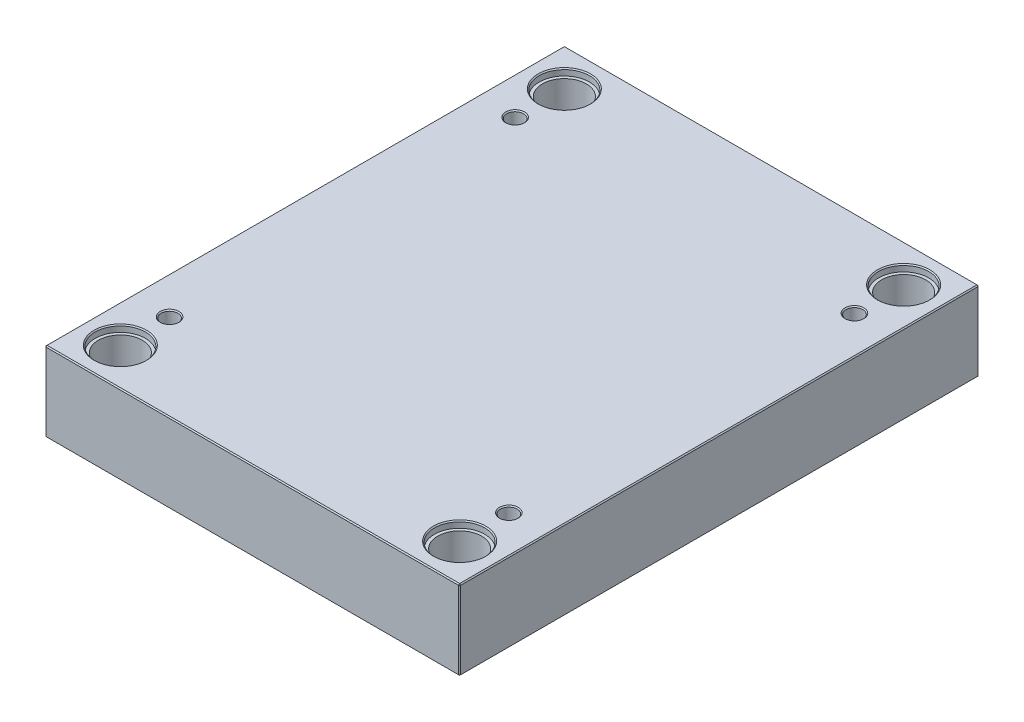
ISO-10303-21;
HEADER;
FILE_DESCRIPTION(('STEP AP214'),'2;1');
FILE_NAME('part.step','',(''),(''),'','','');
FILE_SCHEMA(('AUTOMOTIVE_DESIGN { 1 0 10303 214 1 1 1 1 }'));
ENDSEC;
DATA;
#1=APPLICATION_CONTEXT('core data for automotive mechanical design processes');
#2=APPLICATION_PROTOCOL_DEFINITION('international standard','automotive_design',2000,#1);
#3=PRODUCT_CONTEXT('',#1,'mechanical');
#4=PRODUCT('Part','Part','',(#3));
#5=PRODUCT_RELATED_PRODUCT_CATEGORY('part','',(#4));
#6=PRODUCT_DEFINITION_FORMATION('','',#4);
#7=PRODUCT_DEFINITION_CONTEXT('part definition',#1,'design');
#8=PRODUCT_DEFINITION('design','',#6,#7);
#9=PRODUCT_DEFINITION_SHAPE('','',#8);
#10=(LENGTH_UNIT() NAMED_UNIT(*) SI_UNIT(.MILLI.,.METRE.));
#11=(NAMED_UNIT(*) PLANE_ANGLE_UNIT() SI_UNIT($,.RADIAN.));
#12=(NAMED_UNIT(*) SI_UNIT($,.STERADIAN.) SOLID_ANGLE_UNIT());
#13=UNCERTAINTY_MEASURE_WITH_UNIT(LENGTH_MEASURE(1.E-05),#10,'distance_accuracy_value','');
#14=(GEOMETRIC_REPRESENTATION_CONTEXT(3) GLOBAL_UNCERTAINTY_ASSIGNED_CONTEXT((#13)) GLOBAL_UNIT_ASSIGNED_CONTEXT((#10,
#11,#12)) REPRESENTATION_CONTEXT('',''));
#15=CARTESIAN_POINT('',(0.,0.,0.));
#16=DIRECTION('',(0.,0.,1.));
#17=DIRECTION('',(1.,0.,0.));
#18=AXIS2_PLACEMENT_3D('',#15,#16,#17);
#19=CARTESIAN_POINT('',(-162.,0.,-212.));
#20=DIRECTION('',(0.,1.,0.));
#21=DIRECTION('',(0.,0.,1.));
#22=AXIS2_PLACEMENT_3D('',#19,#20,#21);
#23=CYLINDRICAL_SURFACE('',#22,21.);
#24=CARTESIAN_POINT('',(-162.,0.999999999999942,-212.));
#25=DIRECTION('',(0.,1.,0.));
#26=DIRECTION('',(0.,0.,1.));
#27=AXIS2_PLACEMENT_3D('',#24,#25,#26);
#28=CIRCLE('',#27,21.);
#29=CARTESIAN_POINT('',(-162.,0.999999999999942,-191.));
#30=VERTEX_POINT('',#29);
#31=EDGE_CURVE('E472',#30,#30,#28,.F.);
#32=ORIENTED_EDGE('',*,*,#31,.T.);
#33=EDGE_LOOP('',(#32));
#34=FACE_BOUND('',#33,.T.);
#35=CARTESIAN_POINT('',(-162.,69.7,-212.));
#36=DIRECTION('',(0.,1.,0.));
#37=DIRECTION('',(0.,0.,1.));
#38=AXIS2_PLACEMENT_3D('',#35,#36,#37);
#39=CIRCLE('',#38,21.);
#40=CARTESIAN_POINT('',(-162.,69.7,-191.));
#41=VERTEX_POINT('',#40);
#42=EDGE_CURVE('E221',#41,#41,#39,.F.);
#43=ORIENTED_EDGE('',*,*,#42,.F.);
#44=EDGE_LOOP('',(#43));
#45=FACE_BOUND('',#44,.T.);
#46=ADVANCED_FACE('F16',(#34,#45),#23,.F.);
#47=CARTESIAN_POINT('',(162.,0.,-212.));
#48=DIRECTION('',(0.,1.,0.));
#49=DIRECTION('',(0.,0.,1.));
#50=AXIS2_PLACEMENT_3D('',#47,#48,#49);
#51=CYLINDRICAL_SURFACE('',#50,21.);
#52=CARTESIAN_POINT('',(162.,0.999999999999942,-212.));
#53=DIRECTION('',(0.,1.,0.));
#54=DIRECTION('',(0.,0.,1.));
#55=AXIS2_PLACEMENT_3D('',#52,#53,#54);
#56=CIRCLE('',#55,21.);
#57=CARTESIAN_POINT('',(162.,0.999999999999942,-191.));
#58=VERTEX_POINT('',#57);
#59=EDGE_CURVE('E474',#58,#58,#56,.F.);
#60=ORIENTED_EDGE('',*,*,#59,.T.);
#61=EDGE_LOOP('',(#60));
#62=FACE_BOUND('',#61,.T.);
#63=CARTESIAN_POINT('',(162.,69.7,-212.));
#64=DIRECTION('',(0.,1.,0.));
#65=DIRECTION('',(0.,0.,1.));
#66=AXIS2_PLACEMENT_3D('',#63,#64,#65);
#67=CIRCLE('',#66,21.);
#68=CARTESIAN_POINT('',(162.,69.7,-191.));
#69=VERTEX_POINT('',#68);
#70=EDGE_CURVE('E218',#69,#69,#67,.F.);
#71=ORIENTED_EDGE('',*,*,#70,.F.);
#72=EDGE_LOOP('',(#71));
#73=FACE_BOUND('',#72,.T.);
#74=ADVANCED_FACE('F263',(#62,#73),#51,.F.);
#75=CARTESIAN_POINT('',(162.,0.,212.));
#76=DIRECTION('',(0.,1.,0.));
#77=DIRECTION('',(0.,0.,1.));
#78=AXIS2_PLACEMENT_3D('',#75,#76,#77);
#79=CYLINDRICAL_SURFACE('',#78,21.);
#80=CARTESIAN_POINT('',(162.,0.999999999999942,212.));
#81=DIRECTION('',(0.,1.,0.));
#82=DIRECTION('',(0.,0.,1.));
#83=AXIS2_PLACEMENT_3D('',#80,#81,#82);
#84=CIRCLE('',#83,21.);
#85=CARTESIAN_POINT('',(162.,0.999999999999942,233.));
#86=VERTEX_POINT('',#85);
#87=EDGE_CURVE('E477',#86,#86,#84,.F.);
#88=ORIENTED_EDGE('',*,*,#87,.T.);
#89=EDGE_LOOP('',(#88));
#90=FACE_BOUND('',#89,.T.);
#91=CARTESIAN_POINT('',(162.,69.7,212.));
#92=DIRECTION('',(0.,1.,0.));
#93=DIRECTION('',(0.,0.,1.));
#94=AXIS2_PLACEMENT_3D('',#91,#92,#93);
#95=CIRCLE('',#94,21.);
#96=CARTESIAN_POINT('',(162.,69.7,233.));
#97=VERTEX_POINT('',#96);
#98=EDGE_CURVE('E214',#97,#97,#95,.F.);
#99=ORIENTED_EDGE('',*,*,#98,.F.);
#100=EDGE_LOOP('',(#99));
#101=FACE_BOUND('',#100,.T.);
#102=ADVANCED_FACE('F270',(#90,#101),#79,.F.);
#103=CARTESIAN_POINT('',(-162.,0.,212.));
#104=DIRECTION('',(0.,1.,0.));
#105=DIRECTION('',(0.,0.,1.));
#106=AXIS2_PLACEMENT_3D('',#103,#104,#105);
#107=CYLINDRICAL_SURFACE('',#106,21.);
#108=CARTESIAN_POINT('',(-162.,0.999999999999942,212.));
#109=DIRECTION('',(0.,1.,0.));
#110=DIRECTION('',(0.,0.,1.));
#111=AXIS2_PLACEMENT_3D('',#108,#109,#110);
#112=CIRCLE('',#111,21.);
#113=CARTESIAN_POINT('',(-162.,0.999999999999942,233.));
#114=VERTEX_POINT('',#113);
#115=EDGE_CURVE('E480',#114,#114,#112,.F.);
#116=ORIENTED_EDGE('',*,*,#115,.T.);
#117=EDGE_LOOP('',(#116));
#118=FACE_BOUND('',#117,.T.);
#119=CARTESIAN_POINT('',(-162.,69.7,212.));
#120=DIRECTION('',(0.,1.,0.));
#121=DIRECTION('',(0.,0.,1.));
#122=AXIS2_PLACEMENT_3D('',#119,#120,#121);
#123=CIRCLE('',#122,21.);
#124=CARTESIAN_POINT('',(-162.,69.7,233.));
#125=VERTEX_POINT('',#124);
#126=EDGE_CURVE('E211',#125,#125,#123,.F.);
#127=ORIENTED_EDGE('',*,*,#126,.F.);
#128=EDGE_LOOP('',(#127));
#129=FACE_BOUND('',#128,.T.);
#130=ADVANCED_FACE('F277',(#118,#129),#107,.F.);
#131=CARTESIAN_POINT('',(-198.,76.,248.));
#132=DIRECTION('',(1.,0.,0.));
#133=DIRECTION('',(0.,0.,-1.));
#134=AXIS2_PLACEMENT_3D('',#131,#132,#133);
#135=PLANE('',#134);
#136=DIRECTION('',(0.,-1.,0.));
#137=VECTOR('',#136,1.);
#138=CARTESIAN_POINT('',(-198.,76.,-247.));
#139=LINE('',#138,#137);
#140=CARTESIAN_POINT('',(-198.,75.,-247.));
#141=VERTEX_POINT('',#140);
#142=CARTESIAN_POINT('',(-198.,1.00000000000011,-247.));
#143=VERTEX_POINT('',#142);
#144=EDGE_CURVE('E487',#141,#143,#139,.T.);
#145=ORIENTED_EDGE('',*,*,#144,.T.);
#146=DIRECTION('',(0.,0.,1.));
#147=VECTOR('',#146,1.);
#148=CARTESIAN_POINT('',(-198.,1.00000000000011,248.));
#149=LINE('',#148,#147);
#150=CARTESIAN_POINT('',(-198.,1.00000000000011,247.));
#151=VERTEX_POINT('',#150);
#152=EDGE_CURVE('E490',#143,#151,#149,.T.);
#153=ORIENTED_EDGE('',*,*,#152,.T.);
#154=DIRECTION('',(0.,1.,0.));
#155=VECTOR('',#154,1.);
#156=CARTESIAN_POINT('',(-198.,76.,247.));
#157=LINE('',#156,#155);
#158=CARTESIAN_POINT('',(-198.,75.,247.));
#159=VERTEX_POINT('',#158);
#160=EDGE_CURVE('E485',#151,#159,#157,.T.);
#161=ORIENTED_EDGE('',*,*,#160,.T.);
#162=DIRECTION('',(0.,0.,-1.));
#163=VECTOR('',#162,1.);
#164=CARTESIAN_POINT('',(-198.,75.,-248.));
#165=LINE('',#164,#163);
#166=EDGE_CURVE('E483',#159,#141,#165,.T.);
#167=ORIENTED_EDGE('',*,*,#166,.T.);
#168=EDGE_LOOP('',(#145,#153,#161,#167));
#169=FACE_BOUND('',#168,.T.);
#170=ADVANCED_FACE('F298',(#169),#135,.F.);
#171=CARTESIAN_POINT('',(198.,76.,248.));
#172=DIRECTION('',(0.,0.,-1.));
#173=DIRECTION('',(-1.,0.,0.));
#174=AXIS2_PLACEMENT_3D('',#171,#172,#173);
#175=PLANE('',#174);
#176=DIRECTION('',(-1.,0.,0.));
#177=VECTOR('',#176,1.);
#178=CARTESIAN_POINT('',(-198.,75.,248.));
#179=LINE('',#178,#177);
#180=CARTESIAN_POINT('',(197.,75.,248.));
#181=VERTEX_POINT('',#180);
#182=CARTESIAN_POINT('',(-197.,75.,248.));
#183=VERTEX_POINT('',#182);
#184=EDGE_CURVE('E509',#181,#183,#179,.T.);
#185=ORIENTED_EDGE('',*,*,#184,.T.);
#186=DIRECTION('',(0.,-1.,0.));
#187=VECTOR('',#186,1.);
#188=CARTESIAN_POINT('',(-197.,76.,248.));
#189=LINE('',#188,#187);
#190=CARTESIAN_POINT('',(-197.,1.00000000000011,248.));
#191=VERTEX_POINT('',#190);
#192=EDGE_CURVE('E515',#183,#191,#189,.T.);
#193=ORIENTED_EDGE('',*,*,#192,.T.);
#194=DIRECTION('',(1.,0.,0.));
#195=VECTOR('',#194,1.);
#196=CARTESIAN_POINT('',(198.,1.00000000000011,248.));
#197=LINE('',#196,#195);
#198=CARTESIAN_POINT('',(197.,1.00000000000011,248.));
#199=VERTEX_POINT('',#198);
#200=EDGE_CURVE('E513',#191,#199,#197,.T.);
#201=ORIENTED_EDGE('',*,*,#200,.T.);
#202=DIRECTION('',(0.,1.,0.));
#203=VECTOR('',#202,1.);
#204=CARTESIAN_POINT('',(197.,76.,248.));
#205=LINE('',#204,#203);
#206=EDGE_CURVE('E511',#199,#181,#205,.T.);
#207=ORIENTED_EDGE('',*,*,#206,.T.);
#208=EDGE_LOOP('',(#185,#193,#201,#207));
#209=FACE_BOUND('',#208,.T.);
#210=ADVANCED_FACE('F294',(#209),#175,.F.);
#211=CARTESIAN_POINT('',(198.,76.,248.));
#212=DIRECTION('',(-1.,0.,0.));
#213=DIRECTION('',(0.,0.,1.));
#214=AXIS2_PLACEMENT_3D('',#211,#212,#213);
#215=PLANE('',#214);
#216=DIRECTION('',(0.,0.,-1.));
#217=VECTOR('',#216,1.);
#218=CARTESIAN_POINT('',(198.,1.00000000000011,248.));
#219=LINE('',#218,#217);
#220=CARTESIAN_POINT('',(198.,1.00000000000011,247.));
#221=VERTEX_POINT('',#220);
#222=CARTESIAN_POINT('',(198.,1.00000000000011,-247.));
#223=VERTEX_POINT('',#222);
#224=EDGE_CURVE('E504',#221,#223,#219,.T.);
#225=ORIENTED_EDGE('',*,*,#224,.T.);
#226=DIRECTION('',(0.,1.,0.));
#227=VECTOR('',#226,1.);
#228=CARTESIAN_POINT('',(198.,76.,-247.));
#229=LINE('',#228,#227);
#230=CARTESIAN_POINT('',(198.,75.,-247.));
#231=VERTEX_POINT('',#230);
#232=EDGE_CURVE('E506',#223,#231,#229,.T.);
#233=ORIENTED_EDGE('',*,*,#232,.T.);
#234=DIRECTION('',(0.,0.,1.));
#235=VECTOR('',#234,1.);
#236=CARTESIAN_POINT('',(198.,75.,248.));
#237=LINE('',#236,#235);
#238=CARTESIAN_POINT('',(198.,75.,247.));
#239=VERTEX_POINT('',#238);
#240=EDGE_CURVE('E500',#231,#239,#237,.T.);
#241=ORIENTED_EDGE('',*,*,#240,.T.);
#242=DIRECTION('',(0.,-1.,0.));
#243=VECTOR('',#242,1.);
#244=CARTESIAN_POINT('',(198.,76.,247.));
#245=LINE('',#244,#243);
#246=EDGE_CURVE('E502',#239,#221,#245,.T.);
#247=ORIENTED_EDGE('',*,*,#246,.T.);
#248=EDGE_LOOP('',(#225,#233,#241,#247));
#249=FACE_BOUND('',#248,.T.);
#250=ADVANCED_FACE('F290',(#249),#215,.F.);
#251=CARTESIAN_POINT('',(198.,76.,-248.));
#252=DIRECTION('',(0.,0.,1.));
#253=DIRECTION('',(1.,0.,0.));
#254=AXIS2_PLACEMENT_3D('',#251,#252,#253);
#255=PLANE('',#254);
#256=DIRECTION('',(0.,-1.,0.));
#257=VECTOR('',#256,1.);
#258=CARTESIAN_POINT('',(197.,76.,-248.));
#259=LINE('',#258,#257);
#260=CARTESIAN_POINT('',(197.,75.,-248.));
#261=VERTEX_POINT('',#260);
#262=CARTESIAN_POINT('',(197.,1.00000000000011,-248.));
#263=VERTEX_POINT('',#262);
#264=EDGE_CURVE('E494',#261,#263,#259,.T.);
#265=ORIENTED_EDGE('',*,*,#264,.T.);
#266=DIRECTION('',(-1.,0.,0.));
#267=VECTOR('',#266,1.);
#268=CARTESIAN_POINT('',(198.,1.00000000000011,-248.));
#269=LINE('',#268,#267);
#270=CARTESIAN_POINT('',(-197.,1.00000000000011,-248.));
#271=VERTEX_POINT('',#270);
#272=EDGE_CURVE('E138',#263,#271,#269,.T.);
#273=ORIENTED_EDGE('',*,*,#272,.T.);
#274=DIRECTION('',(0.,1.,0.));
#275=VECTOR('',#274,1.);
#276=CARTESIAN_POINT('',(-197.,76.,-248.));
#277=LINE('',#276,#275);
#278=CARTESIAN_POINT('',(-197.,75.,-248.));
#279=VERTEX_POINT('',#278);
#280=EDGE_CURVE('E496',#271,#279,#277,.T.);
#281=ORIENTED_EDGE('',*,*,#280,.T.);
#282=DIRECTION('',(1.,0.,0.));
#283=VECTOR('',#282,1.);
#284=CARTESIAN_POINT('',(198.,75.,-248.));
#285=LINE('',#284,#283);
#286=EDGE_CURVE('E492',#279,#261,#285,.T.);
#287=ORIENTED_EDGE('',*,*,#286,.T.);
#288=EDGE_LOOP('',(#265,#273,#281,#287));
#289=FACE_BOUND('',#288,.T.);
#290=ADVANCED_FACE('F282',(#289),#255,.F.);
#291=CARTESIAN_POINT('',(0.,76.,0.));
#292=DIRECTION('',(0.,1.,0.));
#293=DIRECTION('',(0.,0.,1.));
#294=AXIS2_PLACEMENT_3D('',#291,#292,#293);
#295=PLANE('',#294);
#296=CARTESIAN_POINT('',(162.,76.,212.));
#297=DIRECTION('',(0.,1.,0.));
#298=DIRECTION('',(0.,0.,1.));
#299=AXIS2_PLACEMENT_3D('',#296,#297,#298);
#300=CIRCLE('',#299,25.);
#301=CARTESIAN_POINT('',(162.,76.,237.));
#302=VERTEX_POINT('',#301);
#303=EDGE_CURVE('E236',#302,#302,#300,.F.);
#304=ORIENTED_EDGE('',*,*,#303,.T.);
#305=EDGE_LOOP('',(#304));
#306=FACE_BOUND('',#305,.T.);
#307=CARTESIAN_POINT('',(-162.,76.,212.));
#308=DIRECTION('',(0.,1.,0.));
#309=DIRECTION('',(0.,0.,1.));
#310=AXIS2_PLACEMENT_3D('',#307,#308,#309);
#311=CIRCLE('',#310,25.);
#312=CARTESIAN_POINT('',(-162.,76.,237.));
#313=VERTEX_POINT('',#312);
#314=EDGE_CURVE('E233',#313,#313,#311,.F.);
#315=ORIENTED_EDGE('',*,*,#314,.T.);
#316=EDGE_LOOP('',(#315));
#317=FACE_BOUND('',#316,.T.);
#318=CARTESIAN_POINT('',(162.,76.,-212.));
#319=DIRECTION('',(0.,1.,0.));
#320=DIRECTION('',(0.,0.,1.));
#321=AXIS2_PLACEMENT_3D('',#318,#319,#320);
#322=CIRCLE('',#321,25.);
#323=CARTESIAN_POINT('',(162.,76.,-187.));
#324=VERTEX_POINT('',#323);
#325=EDGE_CURVE('E230',#324,#324,#322,.F.);
#326=ORIENTED_EDGE('',*,*,#325,.T.);
#327=EDGE_LOOP('',(#326));
#328=FACE_BOUND('',#327,.T.);
#329=CARTESIAN_POINT('',(-162.,76.,-212.));
#330=DIRECTION('',(0.,1.,0.));
#331=DIRECTION('',(0.,0.,1.));
#332=AXIS2_PLACEMENT_3D('',#329,#330,#331);
#333=CIRCLE('',#332,25.);
#334=CARTESIAN_POINT('',(-162.,76.,-187.));
#335=VERTEX_POINT('',#334);
#336=EDGE_CURVE('E227',#335,#335,#333,.F.);
#337=ORIENTED_EDGE('',*,*,#336,.T.);
#338=EDGE_LOOP('',(#337));
#339=FACE_BOUND('',#338,.T.);
#340=CARTESIAN_POINT('',(-162.,76.,165.));
#341=DIRECTION('',(0.,1.,0.));
#342=DIRECTION('',(0.,0.,1.));
#343=AXIS2_PLACEMENT_3D('',#340,#341,#342);
#344=CIRCLE('',#343,9.00000000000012);
#345=CARTESIAN_POINT('',(-162.,76.,174.));
#346=VERTEX_POINT('',#345);
#347=EDGE_CURVE('E198',#346,#346,#344,.F.);
#348=ORIENTED_EDGE('',*,*,#347,.T.);
#349=EDGE_LOOP('',(#348));
#350=FACE_BOUND('',#349,.T.);
#351=CARTESIAN_POINT('',(162.,76.,165.));
#352=DIRECTION('',(0.,1.,0.));
#353=DIRECTION('',(0.,0.,1.));
#354=AXIS2_PLACEMENT_3D('',#351,#352,#353);
#355=CIRCLE('',#354,9.00000000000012);
#356=CARTESIAN_POINT('',(162.,76.,174.));
#357=VERTEX_POINT('',#356);
#358=EDGE_CURVE('E195',#357,#357,#355,.F.);
#359=ORIENTED_EDGE('',*,*,#358,.T.);
#360=EDGE_LOOP('',(#359));
#361=FACE_BOUND('',#360,.T.);
#362=CARTESIAN_POINT('',(162.,76.,-165.));
#363=DIRECTION('',(0.,1.,0.));
#364=DIRECTION('',(0.,0.,1.));
#365=AXIS2_PLACEMENT_3D('',#362,#363,#364);
#366=CIRCLE('',#365,9.);
#367=CARTESIAN_POINT('',(162.,76.,-156.));
#368=VERTEX_POINT('',#367);
#369=EDGE_CURVE('E192',#368,#368,#366,.F.);
#370=ORIENTED_EDGE('',*,*,#369,.T.);
#371=EDGE_LOOP('',(#370));
#372=FACE_BOUND('',#371,.T.);
#373=CARTESIAN_POINT('',(-162.,76.,-165.));
#374=DIRECTION('',(0.,1.,0.));
#375=DIRECTION('',(0.,0.,1.));
#376=AXIS2_PLACEMENT_3D('',#373,#374,#375);
#377=CIRCLE('',#376,9.00000000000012);
#378=CARTESIAN_POINT('',(-162.,76.,-156.));
#379=VERTEX_POINT('',#378);
#380=EDGE_CURVE('E188',#379,#379,#377,.F.);
#381=ORIENTED_EDGE('',*,*,#380,.T.);
#382=EDGE_LOOP('',(#381));
#383=FACE_BOUND('',#382,.T.);
#384=DIRECTION('',(0.,0.,-1.));
#385=VECTOR('',#384,1.);
#386=CARTESIAN_POINT('',(197.,76.,-248.));
#387=LINE('',#386,#385);
#388=CARTESIAN_POINT('',(197.,76.,247.));
#389=VERTEX_POINT('',#388);
#390=CARTESIAN_POINT('',(197.,76.,-247.));
#391=VERTEX_POINT('',#390);
#392=EDGE_CURVE('E31',#389,#391,#387,.T.);
#393=ORIENTED_EDGE('',*,*,#392,.T.);
#394=DIRECTION('',(-1.,0.,0.));
#395=VECTOR('',#394,1.);
#396=CARTESIAN_POINT('',(-198.,76.,-247.));
#397=LINE('',#396,#395);
#398=CARTESIAN_POINT('',(-197.,76.,-247.));
#399=VERTEX_POINT('',#398);
#400=EDGE_CURVE('E189',#391,#399,#397,.T.);
#401=ORIENTED_EDGE('',*,*,#400,.T.);
#402=DIRECTION('',(0.,0.,1.));
#403=VECTOR('',#402,1.);
#404=CARTESIAN_POINT('',(-197.,76.,248.));
#405=LINE('',#404,#403);
#406=CARTESIAN_POINT('',(-197.,76.,247.));
#407=VERTEX_POINT('',#406);
#408=EDGE_CURVE('E518',#399,#407,#405,.T.);
#409=ORIENTED_EDGE('',*,*,#408,.T.);
#410=DIRECTION('',(1.,0.,0.));
#411=VECTOR('',#410,1.);
#412=CARTESIAN_POINT('',(198.,76.,247.));
#413=LINE('',#412,#411);
#414=EDGE_CURVE('E36',#407,#389,#413,.T.);
#415=ORIENTED_EDGE('',*,*,#414,.T.);
#416=EDGE_LOOP('',(#393,#401,#409,#415));
#417=FACE_BOUND('',#416,.T.);
#418=ADVANCED_FACE('F279',(#306,#317,#328,#339,#350,#361,#372,#383,#417),#295,.T.);
#419=CARTESIAN_POINT('',(0.,0.,0.));
#420=DIRECTION('',(0.,1.,0.));
#421=DIRECTION('',(0.,0.,1.));
#422=AXIS2_PLACEMENT_3D('',#419,#420,#421);
#423=PLANE('',#422);
#424=CARTESIAN_POINT('',(-162.,0.,-212.));
#425=DIRECTION('',(0.,1.,0.));
#426=DIRECTION('',(0.,0.,1.));
#427=AXIS2_PLACEMENT_3D('',#424,#425,#426);
#428=CIRCLE('',#427,22.);
#429=CARTESIAN_POINT('',(-162.,0.,-190.));
#430=VERTEX_POINT('',#429);
#431=EDGE_CURVE('E469',#430,#430,#428,.T.);
#432=ORIENTED_EDGE('',*,*,#431,.T.);
#433=EDGE_LOOP('',(#432));
#434=FACE_BOUND('',#433,.T.);
#435=CARTESIAN_POINT('',(162.,0.,-212.));
#436=DIRECTION('',(0.,1.,0.));
#437=DIRECTION('',(0.,0.,1.));
#438=AXIS2_PLACEMENT_3D('',#435,#436,#437);
#439=CIRCLE('',#438,22.);
#440=CARTESIAN_POINT('',(162.,0.,-190.));
#441=VERTEX_POINT('',#440);
#442=EDGE_CURVE('E466',#441,#441,#439,.T.);
#443=ORIENTED_EDGE('',*,*,#442,.T.);
#444=EDGE_LOOP('',(#443));
#445=FACE_BOUND('',#444,.T.);
#446=CARTESIAN_POINT('',(162.,0.,212.));
#447=DIRECTION('',(0.,1.,0.));
#448=DIRECTION('',(0.,0.,1.));
#449=AXIS2_PLACEMENT_3D('',#446,#447,#448);
#450=CIRCLE('',#449,22.);
#451=CARTESIAN_POINT('',(162.,0.,234.));
#452=VERTEX_POINT('',#451);
#453=EDGE_CURVE('E463',#452,#452,#450,.T.);
#454=ORIENTED_EDGE('',*,*,#453,.T.);
#455=EDGE_LOOP('',(#454));
#456=FACE_BOUND('',#455,.T.);
#457=CARTESIAN_POINT('',(-162.,0.,212.));
#458=DIRECTION('',(0.,1.,0.));
#459=DIRECTION('',(0.,0.,1.));
#460=AXIS2_PLACEMENT_3D('',#457,#458,#459);
#461=CIRCLE('',#460,22.);
#462=CARTESIAN_POINT('',(-162.,0.,234.));
#463=VERTEX_POINT('',#462);
#464=EDGE_CURVE('E460',#463,#463,#461,.T.);
#465=ORIENTED_EDGE('',*,*,#464,.T.);
#466=EDGE_LOOP('',(#465));
#467=FACE_BOUND('',#466,.T.);
#468=DIRECTION('',(0.,0.,1.));
#469=VECTOR('',#468,1.);
#470=CARTESIAN_POINT('',(197.,0.,0.));
#471=LINE('',#470,#469);
#472=CARTESIAN_POINT('',(197.,0.,-247.));
#473=VERTEX_POINT('',#472);
#474=CARTESIAN_POINT('',(197.,0.,247.));
#475=VERTEX_POINT('',#474);
#476=EDGE_CURVE('E108',#473,#475,#471,.T.);
#477=ORIENTED_EDGE('',*,*,#476,.T.);
#478=DIRECTION('',(-1.,0.,0.));
#479=VECTOR('',#478,1.);
#480=CARTESIAN_POINT('',(0.,0.,247.));
#481=LINE('',#480,#479);
#482=CARTESIAN_POINT('',(-197.,0.,247.));
#483=VERTEX_POINT('',#482);
#484=EDGE_CURVE('E458',#475,#483,#481,.T.);
#485=ORIENTED_EDGE('',*,*,#484,.T.);
#486=DIRECTION('',(0.,0.,-1.));
#487=VECTOR('',#486,1.);
#488=CARTESIAN_POINT('',(-197.,0.,0.));
#489=LINE('',#488,#487);
#490=CARTESIAN_POINT('',(-197.,0.,-247.));
#491=VERTEX_POINT('',#490);
#492=EDGE_CURVE('E110',#483,#491,#489,.T.);
#493=ORIENTED_EDGE('',*,*,#492,.T.);
#494=DIRECTION('',(1.,0.,0.));
#495=VECTOR('',#494,1.);
#496=CARTESIAN_POINT('',(0.,0.,-247.));
#497=LINE('',#496,#495);
#498=EDGE_CURVE('E104',#491,#473,#497,.T.);
#499=ORIENTED_EDGE('',*,*,#498,.T.);
#500=EDGE_LOOP('',(#477,#485,#493,#499));
#501=FACE_BOUND('',#500,.T.);
#502=ADVANCED_FACE('F106',(#434,#445,#456,#467,#501),#423,.F.);
#503=CARTESIAN_POINT('',(-162.,0.,-212.));
#504=DIRECTION('',(0.,-1.,0.));
#505=DIRECTION('',(0.,0.,-1.));
#506=AXIS2_PLACEMENT_3D('',#503,#504,#505);
#507=CONICAL_SURFACE('',#506,22.,0.785398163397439);
#508=ORIENTED_EDGE('',*,*,#31,.F.);
#509=EDGE_LOOP('',(#508));
#510=FACE_BOUND('',#509,.T.);
#511=ORIENTED_EDGE('',*,*,#431,.F.);
#512=EDGE_LOOP('',(#511));
#513=FACE_BOUND('',#512,.T.);
#514=ADVANCED_FACE('F286',(#510,#513),#507,.F.);
#515=CARTESIAN_POINT('',(162.,0.,-212.));
#516=DIRECTION('',(0.,-1.,0.));
#517=DIRECTION('',(0.,0.,-1.));
#518=AXIS2_PLACEMENT_3D('',#515,#516,#517);
#519=CONICAL_SURFACE('',#518,22.,0.785398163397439);
#520=ORIENTED_EDGE('',*,*,#59,.F.);
#521=EDGE_LOOP('',(#520));
#522=FACE_BOUND('',#521,.T.);
#523=ORIENTED_EDGE('',*,*,#442,.F.);
#524=EDGE_LOOP('',(#523));
#525=FACE_BOUND('',#524,.T.);
#526=ADVANCED_FACE('F305',(#522,#525),#519,.F.);
#527=CARTESIAN_POINT('',(162.,0.,212.));
#528=DIRECTION('',(0.,-1.,0.));
#529=DIRECTION('',(0.,0.,-1.));
#530=AXIS2_PLACEMENT_3D('',#527,#528,#529);
#531=CONICAL_SURFACE('',#530,22.,0.785398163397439);
#532=ORIENTED_EDGE('',*,*,#87,.F.);
#533=EDGE_LOOP('',(#532));
#534=FACE_BOUND('',#533,.T.);
#535=ORIENTED_EDGE('',*,*,#453,.F.);
#536=EDGE_LOOP('',(#535));
#537=FACE_BOUND('',#536,.T.);
#538=ADVANCED_FACE('F309',(#534,#537),#531,.F.);
#539=CARTESIAN_POINT('',(-162.,0.,212.));
#540=DIRECTION('',(0.,-1.,0.));
#541=DIRECTION('',(0.,0.,-1.));
#542=AXIS2_PLACEMENT_3D('',#539,#540,#541);
#543=CONICAL_SURFACE('',#542,22.,0.785398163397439);
#544=ORIENTED_EDGE('',*,*,#115,.F.);
#545=EDGE_LOOP('',(#544));
#546=FACE_BOUND('',#545,.T.);
#547=ORIENTED_EDGE('',*,*,#464,.F.);
#548=EDGE_LOOP('',(#547));
#549=FACE_BOUND('',#548,.T.);
#550=ADVANCED_FACE('F313',(#546,#549),#543,.F.);
#551=CARTESIAN_POINT('',(198.,76.,247.));
#552=DIRECTION('',(-0.707106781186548,0.,-0.707106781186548));
#553=DIRECTION('',(0.,-1.,0.));
#554=AXIS2_PLACEMENT_3D('',#551,#552,#553);
#555=PLANE('',#554);
#556=DIRECTION('',(-0.707106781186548,0.,0.707106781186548));
#557=VECTOR('',#556,1.);
#558=CARTESIAN_POINT('',(197.,75.,248.));
#559=LINE('',#558,#557);
#560=EDGE_CURVE('E126',#181,#239,#559,.F.);
#561=ORIENTED_EDGE('',*,*,#560,.F.);
#562=ORIENTED_EDGE('',*,*,#206,.F.);
#563=DIRECTION('',(0.707106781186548,0.,-0.707106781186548));
#564=VECTOR('',#563,1.);
#565=CARTESIAN_POINT('',(197.,1.00000000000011,248.));
#566=LINE('',#565,#564);
#567=EDGE_CURVE('E180',#221,#199,#566,.F.);
#568=ORIENTED_EDGE('',*,*,#567,.F.);
#569=ORIENTED_EDGE('',*,*,#246,.F.);
#570=EDGE_LOOP('',(#561,#562,#568,#569));
#571=FACE_BOUND('',#570,.T.);
#572=ADVANCED_FACE('F317',(#571),#555,.F.);
#573=CARTESIAN_POINT('',(197.,75.,248.));
#574=DIRECTION('',(0.577350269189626,0.577350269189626,0.577350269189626));
#575=DIRECTION('',(0.707106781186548,0.,-0.707106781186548));
#576=AXIS2_PLACEMENT_3D('',#573,#574,#575);
#577=PLANE('',#576);
#578=DIRECTION('',(0.,-0.707106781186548,0.707106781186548));
#579=VECTOR('',#578,1.);
#580=CARTESIAN_POINT('',(197.,75.,248.));
#581=LINE('',#580,#579);
#582=EDGE_CURVE('E175',#181,#389,#581,.F.);
#583=ORIENTED_EDGE('',*,*,#582,.F.);
#584=ORIENTED_EDGE('',*,*,#560,.T.);
#585=DIRECTION('',(-0.707106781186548,0.707106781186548,0.));
#586=VECTOR('',#585,1.);
#587=CARTESIAN_POINT('',(197.5,75.5,247.));
#588=LINE('',#587,#586);
#589=EDGE_CURVE('E177',#389,#239,#588,.F.);
#590=ORIENTED_EDGE('',*,*,#589,.F.);
#591=EDGE_LOOP('',(#583,#584,#590));
#592=FACE_BOUND('',#591,.T.);
#593=ADVANCED_FACE('F385',(#592),#577,.T.);
#594=CARTESIAN_POINT('',(197.,1.00000000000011,248.));
#595=DIRECTION('',(0.577350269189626,-0.577350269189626,0.577350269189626));
#596=DIRECTION('',(0.707106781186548,0.,-0.707106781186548));
#597=AXIS2_PLACEMENT_3D('',#594,#595,#596);
#598=PLANE('',#597);
#599=DIRECTION('',(-0.707106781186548,-0.707106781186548,0.));
#600=VECTOR('',#599,1.);
#601=CARTESIAN_POINT('',(197.5,0.500000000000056,247.));
#602=LINE('',#601,#600);
#603=EDGE_CURVE('E124',#221,#475,#602,.T.);
#604=ORIENTED_EDGE('',*,*,#603,.F.);
#605=ORIENTED_EDGE('',*,*,#567,.T.);
#606=DIRECTION('',(0.,0.707106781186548,0.707106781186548));
#607=VECTOR('',#606,1.);
#608=CARTESIAN_POINT('',(197.,1.00000000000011,248.));
#609=LINE('',#608,#607);
#610=EDGE_CURVE('E172',#475,#199,#609,.T.);
#611=ORIENTED_EDGE('',*,*,#610,.F.);
#612=EDGE_LOOP('',(#604,#605,#611));
#613=FACE_BOUND('',#612,.T.);
#614=ADVANCED_FACE('F381',(#613),#598,.T.);
#615=CARTESIAN_POINT('',(197.,76.,0.));
#616=DIRECTION('',(0.707106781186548,0.707106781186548,0.));
#617=DIRECTION('',(0.,0.,1.));
#618=AXIS2_PLACEMENT_3D('',#615,#616,#617);
#619=PLANE('',#618);
#620=ORIENTED_EDGE('',*,*,#589,.T.);
#621=ORIENTED_EDGE('',*,*,#240,.F.);
#622=DIRECTION('',(0.707106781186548,-0.707106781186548,0.));
#623=VECTOR('',#622,1.);
#624=CARTESIAN_POINT('',(198.,75.,-247.));
#625=LINE('',#624,#623);
#626=EDGE_CURVE('E166',#391,#231,#625,.T.);
#627=ORIENTED_EDGE('',*,*,#626,.F.);
#628=ORIENTED_EDGE('',*,*,#392,.F.);
#629=EDGE_LOOP('',(#620,#621,#627,#628));
#630=FACE_BOUND('',#629,.T.);
#631=ADVANCED_FACE('F377',(#630),#619,.T.);
#632=CARTESIAN_POINT('',(0.,76.,247.));
#633=DIRECTION('',(0.,0.707106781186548,0.707106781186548));
#634=DIRECTION('',(-1.,0.,0.));
#635=AXIS2_PLACEMENT_3D('',#632,#633,#634);
#636=PLANE('',#635);
#637=ORIENTED_EDGE('',*,*,#582,.T.);
#638=ORIENTED_EDGE('',*,*,#414,.F.);
#639=DIRECTION('',(0.,0.707106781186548,-0.707106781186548));
#640=VECTOR('',#639,1.);
#641=CARTESIAN_POINT('',(-197.,75.5,247.5));
#642=LINE('',#641,#640);
#643=EDGE_CURVE('E163',#183,#407,#642,.T.);
#644=ORIENTED_EDGE('',*,*,#643,.F.);
#645=ORIENTED_EDGE('',*,*,#184,.F.);
#646=EDGE_LOOP('',(#637,#638,#644,#645));
#647=FACE_BOUND('',#646,.T.);
#648=ADVANCED_FACE('F373',(#647),#636,.T.);
#649=CARTESIAN_POINT('',(-197.,76.,248.));
#650=DIRECTION('',(0.707106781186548,0.,-0.707106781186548));
#651=DIRECTION('',(0.,-1.,0.));
#652=AXIS2_PLACEMENT_3D('',#649,#650,#651);
#653=PLANE('',#652);
#654=DIRECTION('',(0.707106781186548,0.,0.707106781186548));
#655=VECTOR('',#654,1.);
#656=CARTESIAN_POINT('',(-197.,1.00000000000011,248.));
#657=LINE('',#656,#655);
#658=EDGE_CURVE('E157',#191,#151,#657,.F.);
#659=ORIENTED_EDGE('',*,*,#658,.F.);
#660=ORIENTED_EDGE('',*,*,#192,.F.);
#661=DIRECTION('',(-0.707106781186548,0.,-0.707106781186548));
#662=VECTOR('',#661,1.);
#663=CARTESIAN_POINT('',(-198.,75.,247.));
#664=LINE('',#663,#662);
#665=EDGE_CURVE('E160',#159,#183,#664,.F.);
#666=ORIENTED_EDGE('',*,*,#665,.F.);
#667=ORIENTED_EDGE('',*,*,#160,.F.);
#668=EDGE_LOOP('',(#659,#660,#666,#667));
#669=FACE_BOUND('',#668,.T.);
#670=ADVANCED_FACE('F369',(#669),#653,.F.);
#671=CARTESIAN_POINT('',(198.,1.00000000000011,248.));
#672=DIRECTION('',(0.,0.707106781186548,-0.707106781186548));
#673=DIRECTION('',(1.,0.,0.));
#674=AXIS2_PLACEMENT_3D('',#671,#672,#673);
#675=PLANE('',#674);
#676=ORIENTED_EDGE('',*,*,#610,.T.);
#677=ORIENTED_EDGE('',*,*,#200,.F.);
#678=DIRECTION('',(0.,-0.707106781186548,-0.707106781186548));
#679=VECTOR('',#678,1.);
#680=CARTESIAN_POINT('',(-197.,1.00000000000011,248.));
#681=LINE('',#680,#679);
#682=EDGE_CURVE('E135',#483,#191,#681,.F.);
#683=ORIENTED_EDGE('',*,*,#682,.F.);
#684=ORIENTED_EDGE('',*,*,#484,.F.);
#685=EDGE_LOOP('',(#676,#677,#683,#684));
#686=FACE_BOUND('',#685,.T.);
#687=ADVANCED_FACE('F366',(#686),#675,.F.);
#688=CARTESIAN_POINT('',(198.,1.00000000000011,248.));
#689=DIRECTION('',(-0.707106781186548,0.707106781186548,0.));
#690=DIRECTION('',(0.,0.,-1.));
#691=AXIS2_PLACEMENT_3D('',#688,#689,#690);
#692=PLANE('',#691);
#693=ORIENTED_EDGE('',*,*,#603,.T.);
#694=ORIENTED_EDGE('',*,*,#476,.F.);
#695=DIRECTION('',(0.707106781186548,0.707106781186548,0.));
#696=VECTOR('',#695,1.);
#697=CARTESIAN_POINT('',(197.5,0.50000000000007,-247.));
#698=LINE('',#697,#696);
#699=EDGE_CURVE('E121',#223,#473,#698,.F.);
#700=ORIENTED_EDGE('',*,*,#699,.F.);
#701=ORIENTED_EDGE('',*,*,#224,.F.);
#702=EDGE_LOOP('',(#693,#694,#700,#701));
#703=FACE_BOUND('',#702,.T.);
#704=ADVANCED_FACE('F119',(#703),#692,.F.);
#705=CARTESIAN_POINT('',(197.,76.,-248.));
#706=DIRECTION('',(-0.707106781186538,0.,0.707106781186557));
#707=DIRECTION('',(0.,-1.,0.));
#708=AXIS2_PLACEMENT_3D('',#705,#706,#707);
#709=PLANE('',#708);
#710=DIRECTION('',(0.707106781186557,0.,0.707106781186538));
#711=VECTOR('',#710,1.);
#712=CARTESIAN_POINT('',(198.,75.,-247.));
#713=LINE('',#712,#711);
#714=EDGE_CURVE('E168',#231,#261,#713,.F.);
#715=ORIENTED_EDGE('',*,*,#714,.F.);
#716=ORIENTED_EDGE('',*,*,#232,.F.);
#717=DIRECTION('',(-0.707106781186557,0.,-0.707106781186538));
#718=VECTOR('',#717,1.);
#719=CARTESIAN_POINT('',(197.,1.00000000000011,-248.));
#720=LINE('',#719,#718);
#721=EDGE_CURVE('E134',#263,#223,#720,.F.);
#722=ORIENTED_EDGE('',*,*,#721,.F.);
#723=ORIENTED_EDGE('',*,*,#264,.F.);
#724=EDGE_LOOP('',(#715,#716,#722,#723));
#725=FACE_BOUND('',#724,.T.);
#726=ADVANCED_FACE('F359',(#725),#709,.F.);
#727=CARTESIAN_POINT('',(198.,75.,-247.));
#728=DIRECTION('',(0.577350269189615,0.577350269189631,-0.577350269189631));
#729=DIRECTION('',(0.,0.707106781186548,0.707106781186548));
#730=AXIS2_PLACEMENT_3D('',#727,#728,#729);
#731=PLANE('',#730);
#732=ORIENTED_EDGE('',*,*,#626,.T.);
#733=ORIENTED_EDGE('',*,*,#714,.T.);
#734=DIRECTION('',(0.,0.707106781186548,0.707106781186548));
#735=VECTOR('',#734,1.);
#736=CARTESIAN_POINT('',(197.,75.5,-247.5));
#737=LINE('',#736,#735);
#738=EDGE_CURVE('E152',#391,#261,#737,.F.);
#739=ORIENTED_EDGE('',*,*,#738,.F.);
#740=EDGE_LOOP('',(#732,#733,#739));
#741=FACE_BOUND('',#740,.T.);
#742=ADVANCED_FACE('F355',(#741),#731,.T.);
#743=CARTESIAN_POINT('',(-198.,75.,247.));
#744=DIRECTION('',(-0.577350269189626,0.577350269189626,0.577350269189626));
#745=DIRECTION('',(0.707106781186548,0.,0.707106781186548));
#746=AXIS2_PLACEMENT_3D('',#743,#744,#745);
#747=PLANE('',#746);
#748=ORIENTED_EDGE('',*,*,#665,.T.);
#749=ORIENTED_EDGE('',*,*,#643,.T.);
#750=DIRECTION('',(-0.707106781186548,-0.707106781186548,0.));
#751=VECTOR('',#750,1.);
#752=CARTESIAN_POINT('',(-198.,75.,247.));
#753=LINE('',#752,#751);
#754=EDGE_CURVE('E143',#159,#407,#753,.F.);
#755=ORIENTED_EDGE('',*,*,#754,.F.);
#756=EDGE_LOOP('',(#748,#749,#755));
#757=FACE_BOUND('',#756,.T.);
#758=ADVANCED_FACE('F351',(#757),#747,.T.);
#759=CARTESIAN_POINT('',(-197.,1.00000000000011,248.));
#760=DIRECTION('',(-0.577350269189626,-0.577350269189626,0.577350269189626));
#761=DIRECTION('',(0.707106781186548,0.,0.707106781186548));
#762=AXIS2_PLACEMENT_3D('',#759,#760,#761);
#763=PLANE('',#762);
#764=ORIENTED_EDGE('',*,*,#682,.T.);
#765=ORIENTED_EDGE('',*,*,#658,.T.);
#766=DIRECTION('',(-0.707106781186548,0.707106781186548,0.));
#767=VECTOR('',#766,1.);
#768=CARTESIAN_POINT('',(-197.5,0.500000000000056,247.));
#769=LINE('',#768,#767);
#770=EDGE_CURVE('E139',#483,#151,#769,.T.);
#771=ORIENTED_EDGE('',*,*,#770,.F.);
#772=EDGE_LOOP('',(#764,#765,#771));
#773=FACE_BOUND('',#772,.T.);
#774=ADVANCED_FACE('F348',(#773),#763,.T.);
#775=CARTESIAN_POINT('',(197.,1.00000000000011,-248.));
#776=DIRECTION('',(0.577350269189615,-0.577350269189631,-0.577350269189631));
#777=DIRECTION('',(0.,0.707106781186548,-0.707106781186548));
#778=AXIS2_PLACEMENT_3D('',#775,#776,#777);
#779=PLANE('',#778);
#780=ORIENTED_EDGE('',*,*,#721,.T.);
#781=ORIENTED_EDGE('',*,*,#699,.T.);
#782=DIRECTION('',(0.,-0.707106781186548,0.707106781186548));
#783=VECTOR('',#782,1.);
#784=CARTESIAN_POINT('',(197.,1.00000000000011,-248.));
#785=LINE('',#784,#783);
#786=EDGE_CURVE('E131',#263,#473,#785,.T.);
#787=ORIENTED_EDGE('',*,*,#786,.F.);
#788=EDGE_LOOP('',(#780,#781,#787));
#789=FACE_BOUND('',#788,.T.);
#790=ADVANCED_FACE('F130',(#789),#779,.T.);
#791=CARTESIAN_POINT('',(0.,76.,-247.));
#792=DIRECTION('',(0.,0.707106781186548,-0.707106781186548));
#793=DIRECTION('',(1.,0.,0.));
#794=AXIS2_PLACEMENT_3D('',#791,#792,#793);
#795=PLANE('',#794);
#796=ORIENTED_EDGE('',*,*,#738,.T.);
#797=ORIENTED_EDGE('',*,*,#286,.F.);
#798=DIRECTION('',(0.,-0.707106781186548,-0.707106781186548));
#799=VECTOR('',#798,1.);
#800=CARTESIAN_POINT('',(-197.,75.,-248.));
#801=LINE('',#800,#799);
#802=EDGE_CURVE('E140',#399,#279,#801,.T.);
#803=ORIENTED_EDGE('',*,*,#802,.F.);
#804=ORIENTED_EDGE('',*,*,#400,.F.);
#805=EDGE_LOOP('',(#796,#797,#803,#804));
#806=FACE_BOUND('',#805,.T.);
#807=ADVANCED_FACE('F341',(#806),#795,.T.);
#808=CARTESIAN_POINT('',(-197.,76.,0.));
#809=DIRECTION('',(-0.707106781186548,0.707106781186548,0.));
#810=DIRECTION('',(0.,0.,-1.));
#811=AXIS2_PLACEMENT_3D('',#808,#809,#810);
#812=PLANE('',#811);
#813=ORIENTED_EDGE('',*,*,#754,.T.);
#814=ORIENTED_EDGE('',*,*,#408,.F.);
#815=DIRECTION('',(0.707106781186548,0.707106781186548,0.));
#816=VECTOR('',#815,1.);
#817=CARTESIAN_POINT('',(-197.5,75.5,-247.));
#818=LINE('',#817,#816);
#819=EDGE_CURVE('E146',#141,#399,#818,.T.);
#820=ORIENTED_EDGE('',*,*,#819,.F.);
#821=ORIENTED_EDGE('',*,*,#166,.F.);
#822=EDGE_LOOP('',(#813,#814,#820,#821));
#823=FACE_BOUND('',#822,.T.);
#824=ADVANCED_FACE('F337',(#823),#812,.T.);
#825=CARTESIAN_POINT('',(-198.,1.00000000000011,248.));
#826=DIRECTION('',(0.707106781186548,0.707106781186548,0.));
#827=DIRECTION('',(0.,0.,1.));
#828=AXIS2_PLACEMENT_3D('',#825,#826,#827);
#829=PLANE('',#828);
#830=ORIENTED_EDGE('',*,*,#770,.T.);
#831=ORIENTED_EDGE('',*,*,#152,.F.);
#832=DIRECTION('',(0.707106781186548,-0.707106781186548,0.));
#833=VECTOR('',#832,1.);
#834=CARTESIAN_POINT('',(-198.,1.00000000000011,-247.));
#835=LINE('',#834,#833);
#836=EDGE_CURVE('E529',#491,#143,#835,.F.);
#837=ORIENTED_EDGE('',*,*,#836,.F.);
#838=ORIENTED_EDGE('',*,*,#492,.F.);
#839=EDGE_LOOP('',(#830,#831,#837,#838));
#840=FACE_BOUND('',#839,.T.);
#841=ADVANCED_FACE('F334',(#840),#829,.F.);
#842=CARTESIAN_POINT('',(198.,1.00000000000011,-248.));
#843=DIRECTION('',(0.,0.707106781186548,0.707106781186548));
#844=DIRECTION('',(-1.,0.,0.));
#845=AXIS2_PLACEMENT_3D('',#842,#843,#844);
#846=PLANE('',#845);
#847=ORIENTED_EDGE('',*,*,#786,.T.);
#848=ORIENTED_EDGE('',*,*,#498,.F.);
#849=DIRECTION('',(0.,0.707106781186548,-0.707106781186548));
#850=VECTOR('',#849,1.);
#851=CARTESIAN_POINT('',(-197.,0.500000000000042,-247.5));
#852=LINE('',#851,#850);
#853=EDGE_CURVE('E526',#271,#491,#852,.F.);
#854=ORIENTED_EDGE('',*,*,#853,.F.);
#855=ORIENTED_EDGE('',*,*,#272,.F.);
#856=EDGE_LOOP('',(#847,#848,#854,#855));
#857=FACE_BOUND('',#856,.T.);
#858=ADVANCED_FACE('F137',(#857),#846,.F.);
#859=CARTESIAN_POINT('',(-197.,75.,-248.));
#860=DIRECTION('',(-0.577350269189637,0.577350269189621,-0.577350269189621));
#861=DIRECTION('',(-0.707106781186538,0.,0.707106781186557));
#862=AXIS2_PLACEMENT_3D('',#859,#860,#861);
#863=PLANE('',#862);
#864=ORIENTED_EDGE('',*,*,#819,.T.);
#865=ORIENTED_EDGE('',*,*,#802,.T.);
#866=DIRECTION('',(0.707106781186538,0.,-0.707106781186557));
#867=VECTOR('',#866,1.);
#868=CARTESIAN_POINT('',(-197.,75.,-248.));
#869=LINE('',#868,#867);
#870=EDGE_CURVE('E524',#141,#279,#869,.T.);
#871=ORIENTED_EDGE('',*,*,#870,.F.);
#872=EDGE_LOOP('',(#864,#865,#871));
#873=FACE_BOUND('',#872,.T.);
#874=ADVANCED_FACE('F327',(#873),#863,.T.);
#875=CARTESIAN_POINT('',(-198.,1.00000000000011,-247.));
#876=DIRECTION('',(-0.577350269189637,-0.577350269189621,-0.577350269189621));
#877=DIRECTION('',(-0.707106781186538,0.,0.707106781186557));
#878=AXIS2_PLACEMENT_3D('',#875,#876,#877);
#879=PLANE('',#878);
#880=ORIENTED_EDGE('',*,*,#853,.T.);
#881=ORIENTED_EDGE('',*,*,#836,.T.);
#882=DIRECTION('',(-0.707106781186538,0.,0.707106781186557));
#883=VECTOR('',#882,1.);
#884=CARTESIAN_POINT('',(-198.,1.00000000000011,-247.));
#885=LINE('',#884,#883);
#886=EDGE_CURVE('E455',#271,#143,#885,.T.);
#887=ORIENTED_EDGE('',*,*,#886,.F.);
#888=EDGE_LOOP('',(#880,#881,#887));
#889=FACE_BOUND('',#888,.T.);
#890=ADVANCED_FACE('F323',(#889),#879,.T.);
#891=CARTESIAN_POINT('',(-198.,76.,-247.));
#892=DIRECTION('',(0.707106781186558,0.,0.707106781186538));
#893=DIRECTION('',(0.,-1.,0.));
#894=AXIS2_PLACEMENT_3D('',#891,#892,#893);
#895=PLANE('',#894);
#896=ORIENTED_EDGE('',*,*,#870,.T.);
#897=ORIENTED_EDGE('',*,*,#280,.F.);
#898=ORIENTED_EDGE('',*,*,#886,.T.);
#899=ORIENTED_EDGE('',*,*,#144,.F.);
#900=EDGE_LOOP('',(#896,#897,#898,#899));
#901=FACE_BOUND('',#900,.T.);
#902=ADVANCED_FACE('F319',(#901),#895,.F.);
#903=CARTESIAN_POINT('',(-162.,51.,-165.));
#904=DIRECTION('',(0.,1.,0.));
#905=DIRECTION('',(0.,0.,1.));
#906=AXIS2_PLACEMENT_3D('',#903,#904,#905);
#907=CYLINDRICAL_SURFACE('',#906,8.);
#908=CARTESIAN_POINT('',(-162.,75.,-165.));
#909=DIRECTION('',(0.,1.,0.));
#910=DIRECTION('',(0.,0.,1.));
#911=AXIS2_PLACEMENT_3D('',#908,#909,#910);
#912=CIRCLE('',#911,8.);
#913=CARTESIAN_POINT('',(-162.,75.,-157.));
#914=VERTEX_POINT('',#913);
#915=EDGE_CURVE('E207',#914,#914,#912,.T.);
#916=ORIENTED_EDGE('',*,*,#915,.T.);
#917=EDGE_LOOP('',(#916));
#918=FACE_BOUND('',#917,.T.);
#919=CARTESIAN_POINT('',(-162.,51.,-165.));
#920=DIRECTION('',(0.,1.,0.));
#921=DIRECTION('',(0.,0.,1.));
#922=AXIS2_PLACEMENT_3D('',#919,#920,#921);
#923=CIRCLE('',#922,8.);
#924=CARTESIAN_POINT('',(-162.,51.,-157.));
#925=VERTEX_POINT('',#924);
#926=EDGE_CURVE('E448',#925,#925,#923,.T.);
#927=ORIENTED_EDGE('',*,*,#926,.F.);
#928=EDGE_LOOP('',(#927));
#929=FACE_BOUND('',#928,.T.);
#930=ADVANCED_FACE('F322',(#918,#929),#907,.F.);
#931=CARTESIAN_POINT('',(-162.,51.,-165.));
#932=DIRECTION('',(0.,1.,0.));
#933=DIRECTION('',(0.,0.,1.));
#934=AXIS2_PLACEMENT_3D('',#931,#932,#933);
#935=PLANE('',#934);
#936=ORIENTED_EDGE('',*,*,#926,.T.);
#937=EDGE_LOOP('',(#936));
#938=FACE_BOUND('',#937,.T.);
#939=ADVANCED_FACE('F596',(#938),#935,.T.);
#940=CARTESIAN_POINT('',(162.,51.,-165.));
#941=DIRECTION('',(0.,1.,0.));
#942=DIRECTION('',(0.,0.,1.));
#943=AXIS2_PLACEMENT_3D('',#940,#941,#942);
#944=CYLINDRICAL_SURFACE('',#943,8.);
#945=CARTESIAN_POINT('',(162.,75.,-165.));
#946=DIRECTION('',(0.,1.,0.));
#947=DIRECTION('',(0.,0.,1.));
#948=AXIS2_PLACEMENT_3D('',#945,#946,#947);
#949=CIRCLE('',#948,8.);
#950=CARTESIAN_POINT('',(162.,75.,-157.));
#951=VERTEX_POINT('',#950);
#952=EDGE_CURVE('E204',#951,#951,#949,.T.);
#953=ORIENTED_EDGE('',*,*,#952,.T.);
#954=EDGE_LOOP('',(#953));
#955=FACE_BOUND('',#954,.T.);
#956=CARTESIAN_POINT('',(162.,51.,-165.));
#957=DIRECTION('',(0.,1.,0.));
#958=DIRECTION('',(0.,0.,1.));
#959=AXIS2_PLACEMENT_3D('',#956,#957,#958);
#960=CIRCLE('',#959,8.);
#961=CARTESIAN_POINT('',(162.,51.,-157.));
#962=VERTEX_POINT('',#961);
#963=EDGE_CURVE('E445',#962,#962,#960,.T.);
#964=ORIENTED_EDGE('',*,*,#963,.F.);
#965=EDGE_LOOP('',(#964));
#966=FACE_BOUND('',#965,.T.);
#967=ADVANCED_FACE('F592',(#955,#966),#944,.F.);
#968=CARTESIAN_POINT('',(162.,51.,-165.));
#969=DIRECTION('',(0.,1.,0.));
#970=DIRECTION('',(0.,0.,1.));
#971=AXIS2_PLACEMENT_3D('',#968,#969,#970);
#972=PLANE('',#971);
#973=ORIENTED_EDGE('',*,*,#963,.T.);
#974=EDGE_LOOP('',(#973));
#975=FACE_BOUND('',#974,.T.);
#976=ADVANCED_FACE('F588',(#975),#972,.T.);
#977=CARTESIAN_POINT('',(162.,51.,165.));
#978=DIRECTION('',(0.,1.,0.));
#979=DIRECTION('',(0.,0.,1.));
#980=AXIS2_PLACEMENT_3D('',#977,#978,#979);
#981=CYLINDRICAL_SURFACE('',#980,8.);
#982=CARTESIAN_POINT('',(162.,75.,165.));
#983=DIRECTION('',(0.,1.,0.));
#984=DIRECTION('',(0.,0.,1.));
#985=AXIS2_PLACEMENT_3D('',#982,#983,#984);
#986=CIRCLE('',#985,8.);
#987=CARTESIAN_POINT('',(162.,75.,173.));
#988=VERTEX_POINT('',#987);
#989=EDGE_CURVE('E201',#988,#988,#986,.T.);
#990=ORIENTED_EDGE('',*,*,#989,.T.);
#991=EDGE_LOOP('',(#990));
#992=FACE_BOUND('',#991,.T.);
#993=CARTESIAN_POINT('',(162.,51.,165.));
#994=DIRECTION('',(0.,1.,0.));
#995=DIRECTION('',(0.,0.,1.));
#996=AXIS2_PLACEMENT_3D('',#993,#994,#995);
#997=CIRCLE('',#996,8.);
#998=CARTESIAN_POINT('',(162.,51.,173.));
#999=VERTEX_POINT('',#998);
#1000=EDGE_CURVE('E449',#999,#999,#997,.T.);
#1001=ORIENTED_EDGE('',*,*,#1000,.F.);
#1002=EDGE_LOOP('',(#1001));
#1003=FACE_BOUND('',#1002,.T.);
#1004=ADVANCED_FACE('F591',(#992,#1003),#981,.F.);
#1005=CARTESIAN_POINT('',(162.,51.,165.));
#1006=DIRECTION('',(0.,1.,0.));
#1007=DIRECTION('',(0.,0.,1.));
#1008=AXIS2_PLACEMENT_3D('',#1005,#1006,#1007);
#1009=PLANE('',#1008);
#1010=ORIENTED_EDGE('',*,*,#1000,.T.);
#1011=EDGE_LOOP('',(#1010));
#1012=FACE_BOUND('',#1011,.T.);
#1013=ADVANCED_FACE('F598',(#1012),#1009,.T.);
#1014=CARTESIAN_POINT('',(-162.,51.,165.));
#1015=DIRECTION('',(0.,1.,0.));
#1016=DIRECTION('',(0.,0.,1.));
#1017=AXIS2_PLACEMENT_3D('',#1014,#1015,#1016);
#1018=CYLINDRICAL_SURFACE('',#1017,8.);
#1019=CARTESIAN_POINT('',(-162.,75.,165.));
#1020=DIRECTION('',(0.,1.,0.));
#1021=DIRECTION('',(0.,0.,1.));
#1022=AXIS2_PLACEMENT_3D('',#1019,#1020,#1021);
#1023=CIRCLE('',#1022,8.);
#1024=CARTESIAN_POINT('',(-162.,75.,173.));
#1025=VERTEX_POINT('',#1024);
#1026=EDGE_CURVE('E185',#1025,#1025,#1023,.T.);
#1027=ORIENTED_EDGE('',*,*,#1026,.T.);
#1028=EDGE_LOOP('',(#1027));
#1029=FACE_BOUND('',#1028,.T.);
#1030=CARTESIAN_POINT('',(-162.,51.,165.));
#1031=DIRECTION('',(0.,1.,0.));
#1032=DIRECTION('',(0.,0.,1.));
#1033=AXIS2_PLACEMENT_3D('',#1030,#1031,#1032);
#1034=CIRCLE('',#1033,8.);
#1035=CARTESIAN_POINT('',(-162.,51.,173.));
#1036=VERTEX_POINT('',#1035);
#1037=EDGE_CURVE('E224',#1036,#1036,#1034,.T.);
#1038=ORIENTED_EDGE('',*,*,#1037,.F.);
#1039=EDGE_LOOP('',(#1038));
#1040=FACE_BOUND('',#1039,.T.);
#1041=ADVANCED_FACE('F601',(#1029,#1040),#1018,.F.);
#1042=CARTESIAN_POINT('',(-162.,51.,165.));
#1043=DIRECTION('',(0.,1.,0.));
#1044=DIRECTION('',(0.,0.,1.));
#1045=AXIS2_PLACEMENT_3D('',#1042,#1043,#1044);
#1046=PLANE('',#1045);
#1047=ORIENTED_EDGE('',*,*,#1037,.T.);
#1048=EDGE_LOOP('',(#1047));
#1049=FACE_BOUND('',#1048,.T.);
#1050=ADVANCED_FACE('F397',(#1049),#1046,.T.);
#1051=CARTESIAN_POINT('',(-162.,75.,165.));
#1052=DIRECTION('',(0.,1.,0.));
#1053=DIRECTION('',(0.,0.,1.));
#1054=AXIS2_PLACEMENT_3D('',#1051,#1052,#1053);
#1055=CONICAL_SURFACE('',#1054,8.,0.785398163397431);
#1056=ORIENTED_EDGE('',*,*,#347,.F.);
#1057=EDGE_LOOP('',(#1056));
#1058=FACE_BOUND('',#1057,.T.);
#1059=ORIENTED_EDGE('',*,*,#1026,.F.);
#1060=EDGE_LOOP('',(#1059));
#1061=FACE_BOUND('',#1060,.T.);
#1062=ADVANCED_FACE('F393',(#1058,#1061),#1055,.F.);
#1063=CARTESIAN_POINT('',(162.,75.,165.));
#1064=DIRECTION('',(0.,1.,0.));
#1065=DIRECTION('',(0.,0.,1.));
#1066=AXIS2_PLACEMENT_3D('',#1063,#1064,#1065);
#1067=CONICAL_SURFACE('',#1066,8.,0.785398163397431);
#1068=ORIENTED_EDGE('',*,*,#358,.F.);
#1069=EDGE_LOOP('',(#1068));
#1070=FACE_BOUND('',#1069,.T.);
#1071=ORIENTED_EDGE('',*,*,#989,.F.);
#1072=EDGE_LOOP('',(#1071));
#1073=FACE_BOUND('',#1072,.T.);
#1074=ADVANCED_FACE('F396',(#1070,#1073),#1067,.F.);
#1075=CARTESIAN_POINT('',(162.,75.,-165.));
#1076=DIRECTION('',(0.,1.,0.));
#1077=DIRECTION('',(0.,0.,1.));
#1078=AXIS2_PLACEMENT_3D('',#1075,#1076,#1077);
#1079=CONICAL_SURFACE('',#1078,8.,0.785398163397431);
#1080=ORIENTED_EDGE('',*,*,#369,.F.);
#1081=EDGE_LOOP('',(#1080));
#1082=FACE_BOUND('',#1081,.T.);
#1083=ORIENTED_EDGE('',*,*,#952,.F.);
#1084=EDGE_LOOP('',(#1083));
#1085=FACE_BOUND('',#1084,.T.);
#1086=ADVANCED_FACE('F401',(#1082,#1085),#1079,.F.);
#1087=CARTESIAN_POINT('',(-162.,75.,-165.));
#1088=DIRECTION('',(0.,1.,0.));
#1089=DIRECTION('',(0.,0.,1.));
#1090=AXIS2_PLACEMENT_3D('',#1087,#1088,#1089);
#1091=CONICAL_SURFACE('',#1090,8.,0.785398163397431);
#1092=ORIENTED_EDGE('',*,*,#380,.F.);
#1093=EDGE_LOOP('',(#1092));
#1094=FACE_BOUND('',#1093,.T.);
#1095=ORIENTED_EDGE('',*,*,#915,.F.);
#1096=EDGE_LOOP('',(#1095));
#1097=FACE_BOUND('',#1096,.T.);
#1098=ADVANCED_FACE('F405',(#1094,#1097),#1091,.F.);
#1099=CARTESIAN_POINT('',(-162.,69.7,212.));
#1100=DIRECTION('',(0.,1.,0.));
#1101=DIRECTION('',(0.,0.,1.));
#1102=AXIS2_PLACEMENT_3D('',#1099,#1100,#1101);
#1103=PLANE('',#1102);
#1104=CARTESIAN_POINT('',(-162.,69.7,212.));
#1105=DIRECTION('',(0.,1.,0.));
#1106=DIRECTION('',(0.,0.,1.));
#1107=AXIS2_PLACEMENT_3D('',#1104,#1105,#1106);
#1108=CIRCLE('',#1107,24.);
#1109=CARTESIAN_POINT('',(-162.,69.7,236.));
#1110=VERTEX_POINT('',#1109);
#1111=EDGE_CURVE('E436',#1110,#1110,#1108,.T.);
#1112=ORIENTED_EDGE('',*,*,#1111,.T.);
#1113=EDGE_LOOP('',(#1112));
#1114=FACE_BOUND('',#1113,.T.);
#1115=ORIENTED_EDGE('',*,*,#126,.T.);
#1116=EDGE_LOOP('',(#1115));
#1117=FACE_BOUND('',#1116,.T.);
#1118=ADVANCED_FACE('F409',(#1114,#1117),#1103,.T.);
#1119=CARTESIAN_POINT('',(-162.,69.7,212.));
#1120=DIRECTION('',(0.,1.,0.));
#1121=DIRECTION('',(0.,0.,1.));
#1122=AXIS2_PLACEMENT_3D('',#1119,#1120,#1121);
#1123=CYLINDRICAL_SURFACE('',#1122,24.);
#1124=CARTESIAN_POINT('',(-162.,75.,212.));
#1125=DIRECTION('',(0.,1.,0.));
#1126=DIRECTION('',(0.,0.,1.));
#1127=AXIS2_PLACEMENT_3D('',#1124,#1125,#1126);
#1128=CIRCLE('',#1127,24.);
#1129=CARTESIAN_POINT('',(-162.,75.,236.));
#1130=VERTEX_POINT('',#1129);
#1131=EDGE_CURVE('E239',#1130,#1130,#1128,.T.);
#1132=ORIENTED_EDGE('',*,*,#1131,.T.);
#1133=EDGE_LOOP('',(#1132));
#1134=FACE_BOUND('',#1133,.T.);
#1135=ORIENTED_EDGE('',*,*,#1111,.F.);
#1136=EDGE_LOOP('',(#1135));
#1137=FACE_BOUND('',#1136,.T.);
#1138=ADVANCED_FACE('F574',(#1134,#1137),#1123,.F.);
#1139=CARTESIAN_POINT('',(162.,69.7,212.));
#1140=DIRECTION('',(0.,1.,0.));
#1141=DIRECTION('',(0.,0.,1.));
#1142=AXIS2_PLACEMENT_3D('',#1139,#1140,#1141);
#1143=PLANE('',#1142);
#1144=CARTESIAN_POINT('',(162.,69.7,212.));
#1145=DIRECTION('',(0.,1.,0.));
#1146=DIRECTION('',(0.,0.,1.));
#1147=AXIS2_PLACEMENT_3D('',#1144,#1145,#1146);
#1148=CIRCLE('',#1147,24.);
#1149=CARTESIAN_POINT('',(162.,69.7,236.));
#1150=VERTEX_POINT('',#1149);
#1151=EDGE_CURVE('E433',#1150,#1150,#1148,.T.);
#1152=ORIENTED_EDGE('',*,*,#1151,.T.);
#1153=EDGE_LOOP('',(#1152));
#1154=FACE_BOUND('',#1153,.T.);
#1155=ORIENTED_EDGE('',*,*,#98,.T.);
#1156=EDGE_LOOP('',(#1155));
#1157=FACE_BOUND('',#1156,.T.);
#1158=ADVANCED_FACE('F429',(#1154,#1157),#1143,.T.);
#1159=CARTESIAN_POINT('',(162.,69.7,212.));
#1160=DIRECTION('',(0.,1.,0.));
#1161=DIRECTION('',(0.,0.,1.));
#1162=AXIS2_PLACEMENT_3D('',#1159,#1160,#1161);
#1163=CYLINDRICAL_SURFACE('',#1162,24.);
#1164=CARTESIAN_POINT('',(162.,75.,212.));
#1165=DIRECTION('',(0.,1.,0.));
#1166=DIRECTION('',(0.,0.,1.));
#1167=AXIS2_PLACEMENT_3D('',#1164,#1165,#1166);
#1168=CIRCLE('',#1167,24.);
#1169=CARTESIAN_POINT('',(162.,75.,236.));
#1170=VERTEX_POINT('',#1169);
#1171=EDGE_CURVE('E210',#1170,#1170,#1168,.T.);
#1172=ORIENTED_EDGE('',*,*,#1171,.T.);
#1173=EDGE_LOOP('',(#1172));
#1174=FACE_BOUND('',#1173,.T.);
#1175=ORIENTED_EDGE('',*,*,#1151,.F.);
#1176=EDGE_LOOP('',(#1175));
#1177=FACE_BOUND('',#1176,.T.);
#1178=ADVANCED_FACE('F425',(#1174,#1177),#1163,.F.);
#1179=CARTESIAN_POINT('',(162.,69.7,-212.));
#1180=DIRECTION('',(0.,1.,0.));
#1181=DIRECTION('',(0.,0.,1.));
#1182=AXIS2_PLACEMENT_3D('',#1179,#1180,#1181);
#1183=PLANE('',#1182);
#1184=CARTESIAN_POINT('',(162.,69.7,-212.));
#1185=DIRECTION('',(0.,1.,0.));
#1186=DIRECTION('',(0.,0.,1.));
#1187=AXIS2_PLACEMENT_3D('',#1184,#1185,#1186);
#1188=CIRCLE('',#1187,24.);
#1189=CARTESIAN_POINT('',(162.,69.7,-188.));
#1190=VERTEX_POINT('',#1189);
#1191=EDGE_CURVE('E435',#1190,#1190,#1188,.T.);
#1192=ORIENTED_EDGE('',*,*,#1191,.T.);
#1193=EDGE_LOOP('',(#1192));
#1194=FACE_BOUND('',#1193,.T.);
#1195=ORIENTED_EDGE('',*,*,#70,.T.);
#1196=EDGE_LOOP('',(#1195));
#1197=FACE_BOUND('',#1196,.T.);
#1198=ADVANCED_FACE('F428',(#1194,#1197),#1183,.T.);
#1199=CARTESIAN_POINT('',(162.,69.7,-212.));
#1200=DIRECTION('',(0.,1.,0.));
#1201=DIRECTION('',(0.,0.,1.));
#1202=AXIS2_PLACEMENT_3D('',#1199,#1200,#1201);
#1203=CYLINDRICAL_SURFACE('',#1202,24.);
#1204=CARTESIAN_POINT('',(162.,75.,-212.));
#1205=DIRECTION('',(0.,1.,0.));
#1206=DIRECTION('',(0.,0.,1.));
#1207=AXIS2_PLACEMENT_3D('',#1204,#1205,#1206);
#1208=CIRCLE('',#1207,24.);
#1209=CARTESIAN_POINT('',(162.,75.,-188.));
#1210=VERTEX_POINT('',#1209);
#1211=EDGE_CURVE('E24',#1210,#1210,#1208,.T.);
#1212=ORIENTED_EDGE('',*,*,#1211,.T.);
#1213=EDGE_LOOP('',(#1212));
#1214=FACE_BOUND('',#1213,.T.);
#1215=ORIENTED_EDGE('',*,*,#1191,.F.);
#1216=EDGE_LOOP('',(#1215));
#1217=FACE_BOUND('',#1216,.T.);
#1218=ADVANCED_FACE('F244',(#1214,#1217),#1203,.F.);
#1219=CARTESIAN_POINT('',(-162.,69.7,-212.));
#1220=DIRECTION('',(0.,1.,0.));
#1221=DIRECTION('',(0.,0.,1.));
#1222=AXIS2_PLACEMENT_3D('',#1219,#1220,#1221);
#1223=PLANE('',#1222);
#1224=CARTESIAN_POINT('',(-162.,69.7,-212.));
#1225=DIRECTION('',(0.,1.,0.));
#1226=DIRECTION('',(0.,0.,1.));
#1227=AXIS2_PLACEMENT_3D('',#1224,#1225,#1226);
#1228=CIRCLE('',#1227,24.);
#1229=CARTESIAN_POINT('',(-162.,69.7,-188.));
#1230=VERTEX_POINT('',#1229);
#1231=EDGE_CURVE('E215',#1230,#1230,#1228,.T.);
#1232=ORIENTED_EDGE('',*,*,#1231,.T.);
#1233=EDGE_LOOP('',(#1232));
#1234=FACE_BOUND('',#1233,.T.);
#1235=ORIENTED_EDGE('',*,*,#42,.T.);
#1236=EDGE_LOOP('',(#1235));
#1237=FACE_BOUND('',#1236,.T.);
#1238=ADVANCED_FACE('F418',(#1234,#1237),#1223,.T.);
#1239=CARTESIAN_POINT('',(-162.,69.7,-212.));
#1240=DIRECTION('',(0.,1.,0.));
#1241=DIRECTION('',(0.,0.,1.));
#1242=AXIS2_PLACEMENT_3D('',#1239,#1240,#1241);
#1243=CYLINDRICAL_SURFACE('',#1242,24.);
#1244=CARTESIAN_POINT('',(-162.,75.,-212.));
#1245=DIRECTION('',(0.,1.,0.));
#1246=DIRECTION('',(0.,0.,1.));
#1247=AXIS2_PLACEMENT_3D('',#1244,#1245,#1246);
#1248=CIRCLE('',#1247,24.);
#1249=CARTESIAN_POINT('',(-162.,75.,-188.));
#1250=VERTEX_POINT('',#1249);
#1251=EDGE_CURVE('E10',#1250,#1250,#1248,.T.);
#1252=ORIENTED_EDGE('',*,*,#1251,.T.);
#1253=EDGE_LOOP('',(#1252));
#1254=FACE_BOUND('',#1253,.T.);
#1255=ORIENTED_EDGE('',*,*,#1231,.F.);
#1256=EDGE_LOOP('',(#1255));
#1257=FACE_BOUND('',#1256,.T.);
#1258=ADVANCED_FACE('F412',(#1254,#1257),#1243,.F.);
#1259=CARTESIAN_POINT('',(162.,75.,212.));
#1260=DIRECTION('',(0.,1.,0.));
#1261=DIRECTION('',(0.,0.,1.));
#1262=AXIS2_PLACEMENT_3D('',#1259,#1260,#1261);
#1263=CONICAL_SURFACE('',#1262,24.,0.785398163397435);
#1264=ORIENTED_EDGE('',*,*,#303,.F.);
#1265=EDGE_LOOP('',(#1264));
#1266=FACE_BOUND('',#1265,.T.);
#1267=ORIENTED_EDGE('',*,*,#1171,.F.);
#1268=EDGE_LOOP('',(#1267));
#1269=FACE_BOUND('',#1268,.T.);
#1270=ADVANCED_FACE('F258',(#1266,#1269),#1263,.F.);
#1271=CARTESIAN_POINT('',(-162.,75.,212.));
#1272=DIRECTION('',(0.,1.,0.));
#1273=DIRECTION('',(0.,0.,1.));
#1274=AXIS2_PLACEMENT_3D('',#1271,#1272,#1273);
#1275=CONICAL_SURFACE('',#1274,24.,0.785398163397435);
#1276=ORIENTED_EDGE('',*,*,#314,.F.);
#1277=EDGE_LOOP('',(#1276));
#1278=FACE_BOUND('',#1277,.T.);
#1279=ORIENTED_EDGE('',*,*,#1131,.F.);
#1280=EDGE_LOOP('',(#1279));
#1281=FACE_BOUND('',#1280,.T.);
#1282=ADVANCED_FACE('F249',(#1278,#1281),#1275,.F.);
#1283=CARTESIAN_POINT('',(162.,75.,-212.));
#1284=DIRECTION('',(0.,1.,0.));
#1285=DIRECTION('',(0.,0.,1.));
#1286=AXIS2_PLACEMENT_3D('',#1283,#1284,#1285);
#1287=CONICAL_SURFACE('',#1286,24.,0.785398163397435);
#1288=ORIENTED_EDGE('',*,*,#325,.F.);
#1289=EDGE_LOOP('',(#1288));
#1290=FACE_BOUND('',#1289,.T.);
#1291=ORIENTED_EDGE('',*,*,#1211,.F.);
#1292=EDGE_LOOP('',(#1291));
#1293=FACE_BOUND('',#1292,.T.);
#1294=ADVANCED_FACE('F247',(#1290,#1293),#1287,.F.);
#1295=CARTESIAN_POINT('',(-162.,75.,-212.));
#1296=DIRECTION('',(0.,1.,0.));
#1297=DIRECTION('',(0.,0.,1.));
#1298=AXIS2_PLACEMENT_3D('',#1295,#1296,#1297);
#1299=CONICAL_SURFACE('',#1298,24.,0.785398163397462);
#1300=ORIENTED_EDGE('',*,*,#336,.F.);
#1301=EDGE_LOOP('',(#1300));
#1302=FACE_BOUND('',#1301,.T.);
#1303=ORIENTED_EDGE('',*,*,#1251,.F.);
#1304=EDGE_LOOP('',(#1303));
#1305=FACE_BOUND('',#1304,.T.);
#1306=ADVANCED_FACE('F18',(#1302,#1305),#1299,.F.);
#1307=CLOSED_SHELL('',(#46,#74,#102,#130,#170,#210,#250,#290,#418,#502,#514,#526,#538,#550,#572,
#593,#614,#631,#648,#670,#687,#704,#726,#742,#758,#774,#790,#807,#824,#841,#858,#874,#890,#902,
#930,#939,#967,#976,#1004,#1013,#1041,#1050,#1062,#1074,#1086,#1098,#1118,#1138,#1158,#1178,
#1198,#1218,#1238,#1258,#1270,#1282,#1294,#1306));
#1308=MANIFOLD_SOLID_BREP('B1',#1307);
#1309=ADVANCED_BREP_SHAPE_REPRESENTATION('',(#18,#1308),#14);
#1310=SHAPE_DEFINITION_REPRESENTATION(#9,#1309);
ENDSEC;
END-ISO-10303-21;
